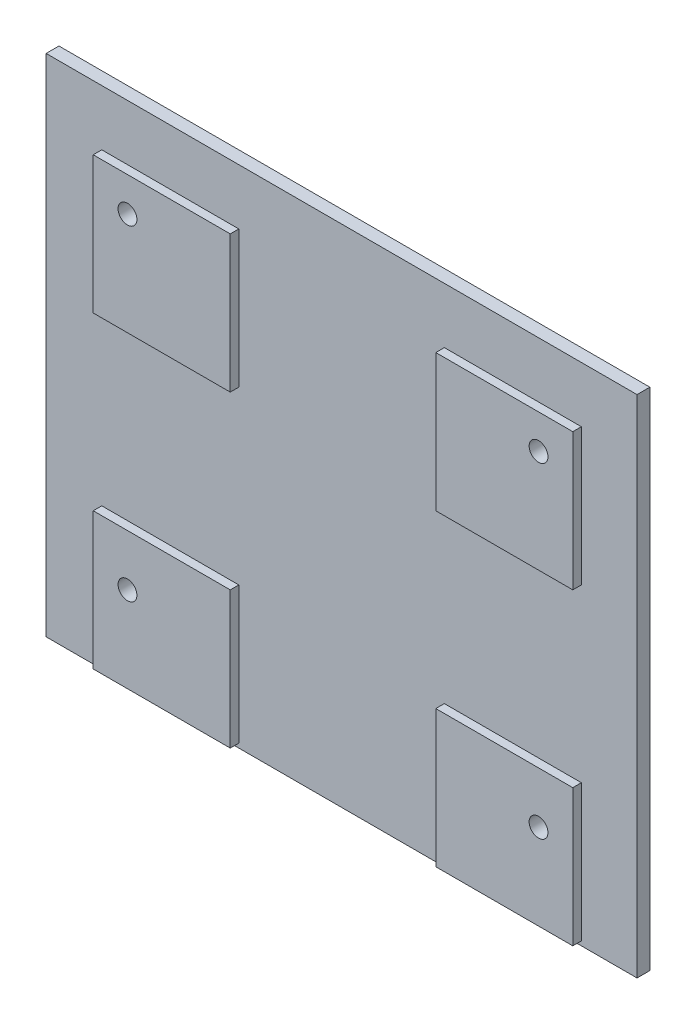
from build123d import *

# Parameters (mm, degrees)
ESQUISSE2_W        = 690
ESQUISSE2_H        = 590
PLAQUE_ROBOT_DEPTH = 15
ESQUISSE8_W        = 160
ESQUISSE8_H        = 160
EXTRUSION1_DEPTH   = 10
EXTRUSION2_REACH   = 456.615
ESQUISSE9_R        = 11


with BuildPart() as part:
    # Esquisse2 → Plaque Robot (new body)
    with BuildSketch(Plane.XY):
        Rectangle(ESQUISSE2_W, ESQUISSE2_H)
    extrude(amount=PLAQUE_ROBOT_DEPTH)

    # Esquisse8 → Extrusion1 (add)
    with BuildSketch(Plane.XY.offset(15)):
        with Locations((-200, -210)):
            Rectangle(ESQUISSE8_W, ESQUISSE8_H)
        with Locations((200, -210)):
            Rectangle(ESQUISSE8_W, ESQUISSE8_H)
        with Locations((200, 150)):
            Rectangle(ESQUISSE8_W, ESQUISSE8_H)
        with Locations((-200, 150)):
            Rectangle(ESQUISSE8_W, ESQUISSE8_H)
    extrude(amount=EXTRUSION1_DEPTH)

    # Esquisse9 → Extrusion2 (cut, up to next)
    with BuildSketch(Plane.XY.offset(25), mode=Mode.PRIVATE) as extrusion2_sk1:
        with Locations((-240, 190)):
            Circle(ESQUISSE9_R)
    extrusion2_tool1 = extrude(extrusion2_sk1.sketch, amount=-EXTRUSION2_REACH, mode=Mode.PRIVATE) & part.part
    # Esquisse9 → Extrusion2 (cut, up to next)
    with BuildSketch(Plane.XY.offset(25), mode=Mode.PRIVATE) as extrusion2_sk2:
        with Locations((240, 190)):
            Circle(ESQUISSE9_R)
    extrusion2_tool2 = extrude(extrusion2_sk2.sketch, amount=-EXTRUSION2_REACH, mode=Mode.PRIVATE) & part.part
    # Esquisse9 → Extrusion2 (cut, up to next)
    with BuildSketch(Plane.XY.offset(25), mode=Mode.PRIVATE) as extrusion2_sk3:
        with Locations((240, -190)):
            Circle(ESQUISSE9_R)
    extrusion2_tool3 = extrude(extrusion2_sk3.sketch, amount=-EXTRUSION2_REACH, mode=Mode.PRIVATE) & part.part
    # Esquisse9 → Extrusion2 (cut, up to next)
    with BuildSketch(Plane.XY.offset(25), mode=Mode.PRIVATE) as extrusion2_sk4:
        with Locations((-240, -190)):
            Circle(ESQUISSE9_R)
    extrusion2_tool4 = extrude(extrusion2_sk4.sketch, amount=-EXTRUSION2_REACH, mode=Mode.PRIVATE) & part.part
    add(extrusion2_tool1.solids().sort_by_distance((-240, 190, 25))[0], mode=Mode.SUBTRACT)
    add(extrusion2_tool2.solids().sort_by_distance((240, 190, 25))[0], mode=Mode.SUBTRACT)
    add(extrusion2_tool3.solids().sort_by_distance((240, -190, 25))[0], mode=Mode.SUBTRACT)
    add(extrusion2_tool4.solids().sort_by_distance((-240, -190, 25))[0], mode=Mode.SUBTRACT)


solid = part.part
